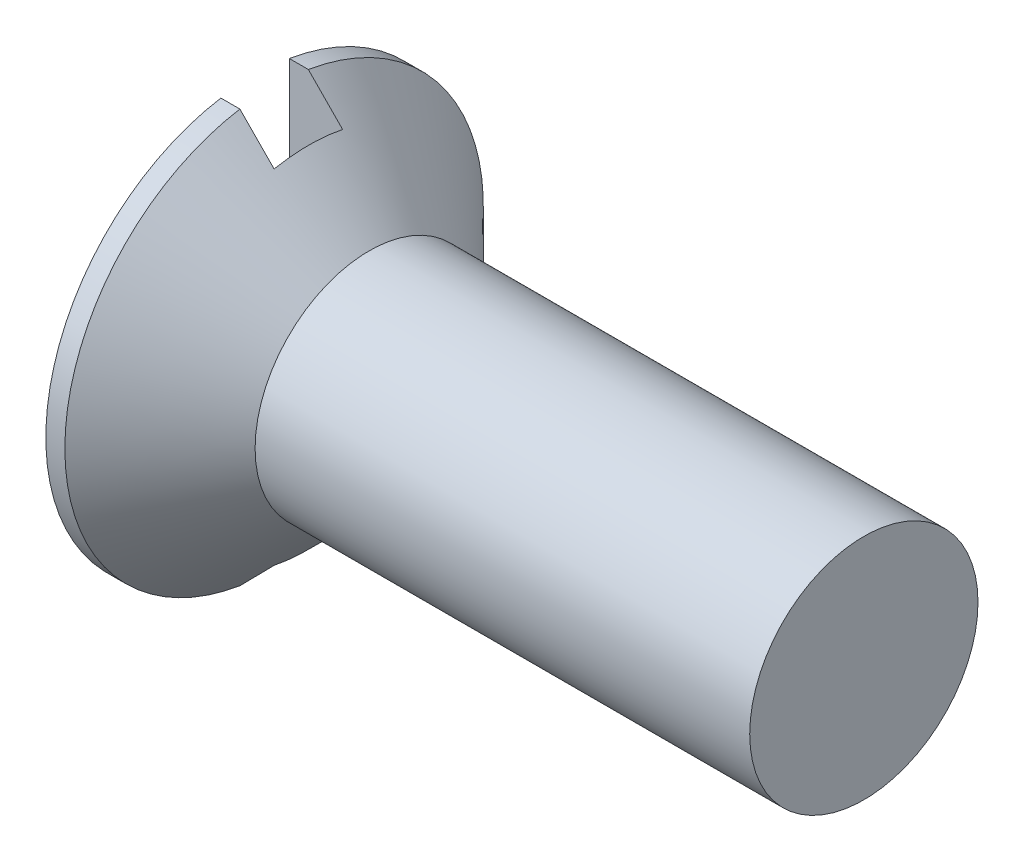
ISO-10303-21;
HEADER;
FILE_DESCRIPTION(('STEP AP214'),'2;1');
FILE_NAME('part.step','',(''),(''),'','','');
FILE_SCHEMA(('AUTOMOTIVE_DESIGN { 1 0 10303 214 1 1 1 1 }'));
ENDSEC;
DATA;
#1=APPLICATION_CONTEXT('core data for automotive mechanical design processes');
#2=APPLICATION_PROTOCOL_DEFINITION('international standard','automotive_design',2000,#1);
#3=PRODUCT_CONTEXT('',#1,'mechanical');
#4=PRODUCT('Part','Part','',(#3));
#5=PRODUCT_RELATED_PRODUCT_CATEGORY('part','',(#4));
#6=PRODUCT_DEFINITION_FORMATION('','',#4);
#7=PRODUCT_DEFINITION_CONTEXT('part definition',#1,'design');
#8=PRODUCT_DEFINITION('design','',#6,#7);
#9=PRODUCT_DEFINITION_SHAPE('','',#8);
#10=(LENGTH_UNIT() NAMED_UNIT(*) SI_UNIT(.MILLI.,.METRE.));
#11=(NAMED_UNIT(*) PLANE_ANGLE_UNIT() SI_UNIT($,.RADIAN.));
#12=(NAMED_UNIT(*) SI_UNIT($,.STERADIAN.) SOLID_ANGLE_UNIT());
#13=UNCERTAINTY_MEASURE_WITH_UNIT(LENGTH_MEASURE(1.E-05),#10,'distance_accuracy_value','');
#14=(GEOMETRIC_REPRESENTATION_CONTEXT(3) GLOBAL_UNCERTAINTY_ASSIGNED_CONTEXT((#13)) GLOBAL_UNIT_ASSIGNED_CONTEXT((#10,
#11,#12)) REPRESENTATION_CONTEXT('',''));
#15=CARTESIAN_POINT('',(0.,0.,0.));
#16=DIRECTION('',(0.,0.,1.));
#17=DIRECTION('',(1.,0.,0.));
#18=AXIS2_PLACEMENT_3D('',#15,#16,#17);
#19=CARTESIAN_POINT('',(0.,0.,0.));
#20=DIRECTION('',(-1.,0.,0.));
#21=DIRECTION('',(0.,0.,1.));
#22=AXIS2_PLACEMENT_3D('',#19,#20,#21);
#23=PLANE('',#22);
#24=CARTESIAN_POINT('',(0.,0.,0.));
#25=DIRECTION('',(-1.,0.,0.));
#26=DIRECTION('',(0.,0.,1.));
#27=AXIS2_PLACEMENT_3D('',#24,#25,#26);
#28=CIRCLE('',#27,5.5);
#29=CARTESIAN_POINT('',(0.,-5.42586398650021,0.9));
#30=VERTEX_POINT('',#29);
#31=CARTESIAN_POINT('',(0.,5.42586398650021,0.9));
#32=VERTEX_POINT('',#31);
#33=EDGE_CURVE('E116',#30,#32,#28,.T.);
#34=ORIENTED_EDGE('',*,*,#33,.T.);
#35=DIRECTION('',(0.,-1.,0.));
#36=VECTOR('',#35,1.);
#37=CARTESIAN_POINT('',(0.,5.42586398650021,0.9));
#38=LINE('',#37,#36);
#39=EDGE_CURVE('E112',#32,#30,#38,.T.);
#40=ORIENTED_EDGE('',*,*,#39,.T.);
#41=EDGE_LOOP('',(#34,#40));
#42=FACE_BOUND('',#41,.T.);
#43=ADVANCED_FACE('F37',(#42),#23,.T.);
#44=CARTESIAN_POINT('',(0.,5.42586398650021,-0.9));
#45=VERTEX_POINT('',#44);
#46=CARTESIAN_POINT('',(0.,-5.42586398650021,-0.900000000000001));
#47=VERTEX_POINT('',#46);
#48=EDGE_CURVE('E111',#45,#47,#28,.T.);
#49=ORIENTED_EDGE('',*,*,#48,.T.);
#50=DIRECTION('',(0.,1.,0.));
#51=VECTOR('',#50,1.);
#52=CARTESIAN_POINT('',(0.,-5.42586398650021,-0.900000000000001));
#53=LINE('',#52,#51);
#54=EDGE_CURVE('E97',#47,#45,#53,.T.);
#55=ORIENTED_EDGE('',*,*,#54,.T.);
#56=EDGE_LOOP('',(#49,#55));
#57=FACE_BOUND('',#56,.T.);
#58=ADVANCED_FACE('F110',(#57),#23,.T.);
#59=CARTESIAN_POINT('',(-6.34999999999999,0.,0.));
#60=DIRECTION('',(-1.,0.,0.));
#61=DIRECTION('',(0.,0.,1.));
#62=AXIS2_PLACEMENT_3D('',#59,#60,#61);
#63=CYLINDRICAL_SURFACE('',#62,5.5);
#64=ORIENTED_EDGE('',*,*,#33,.F.);
#65=DIRECTION('',(-1.,0.,0.));
#66=VECTOR('',#65,1.);
#67=CARTESIAN_POINT('',(1.4,-5.42586398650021,0.9));
#68=LINE('',#67,#66);
#69=CARTESIAN_POINT('',(0.500000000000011,-5.42586398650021,0.9));
#70=VERTEX_POINT('',#69);
#71=EDGE_CURVE('E163',#70,#30,#68,.T.);
#72=ORIENTED_EDGE('',*,*,#71,.F.);
#73=CARTESIAN_POINT('',(0.50000000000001,0.,0.));
#74=DIRECTION('',(-1.,0.,0.));
#75=DIRECTION('',(0.,0.,1.));
#76=AXIS2_PLACEMENT_3D('',#73,#74,#75);
#77=CIRCLE('',#76,5.5);
#78=CARTESIAN_POINT('',(0.50000000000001,5.42586398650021,0.9));
#79=VERTEX_POINT('',#78);
#80=EDGE_CURVE('E124',#70,#79,#77,.T.);
#81=ORIENTED_EDGE('',*,*,#80,.T.);
#82=DIRECTION('',(-1.,0.,0.));
#83=VECTOR('',#82,1.);
#84=CARTESIAN_POINT('',(1.4,5.42586398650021,0.9));
#85=LINE('',#84,#83);
#86=EDGE_CURVE('E64',#79,#32,#85,.T.);
#87=ORIENTED_EDGE('',*,*,#86,.T.);
#88=EDGE_LOOP('',(#64,#72,#81,#87));
#89=FACE_BOUND('',#88,.T.);
#90=ADVANCED_FACE('F157',(#89),#63,.T.);
#91=ORIENTED_EDGE('',*,*,#48,.F.);
#92=DIRECTION('',(-1.,0.,0.));
#93=VECTOR('',#92,1.);
#94=CARTESIAN_POINT('',(1.4,5.42586398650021,-0.9));
#95=LINE('',#94,#93);
#96=CARTESIAN_POINT('',(0.50000000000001,5.42586398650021,-0.9));
#97=VERTEX_POINT('',#96);
#98=EDGE_CURVE('E94',#97,#45,#95,.T.);
#99=ORIENTED_EDGE('',*,*,#98,.F.);
#100=CARTESIAN_POINT('',(0.500000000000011,-5.42586398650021,-0.900000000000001));
#101=VERTEX_POINT('',#100);
#102=EDGE_CURVE('E122',#97,#101,#77,.T.);
#103=ORIENTED_EDGE('',*,*,#102,.T.);
#104=DIRECTION('',(-1.,0.,0.));
#105=VECTOR('',#104,1.);
#106=CARTESIAN_POINT('',(1.4,-5.42586398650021,-0.900000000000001));
#107=LINE('',#106,#105);
#108=EDGE_CURVE('E106',#101,#47,#107,.T.);
#109=ORIENTED_EDGE('',*,*,#108,.T.);
#110=EDGE_LOOP('',(#91,#99,#103,#109));
#111=FACE_BOUND('',#110,.T.);
#112=ADVANCED_FACE('F114',(#111),#63,.T.);
#113=CARTESIAN_POINT('',(0.50000000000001,0.,0.));
#114=DIRECTION('',(-1.,0.,0.));
#115=DIRECTION('',(0.,0.,1.));
#116=AXIS2_PLACEMENT_3D('',#113,#114,#115);
#117=CONICAL_SURFACE('',#116,5.5,0.78539816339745);
#118=CARTESIAN_POINT('',(3.,0.,0.));
#119=DIRECTION('',(-1.,0.,0.));
#120=DIRECTION('',(0.,0.,1.));
#121=AXIS2_PLACEMENT_3D('',#118,#119,#120);
#122=CIRCLE('',#121,3.);
#123=CARTESIAN_POINT('',(3.,0.,3.));
#124=VERTEX_POINT('',#123);
#125=EDGE_CURVE('E167',#124,#124,#122,.T.);
#126=ORIENTED_EDGE('',*,*,#125,.T.);
#127=EDGE_LOOP('',(#126));
#128=FACE_BOUND('',#127,.T.);
#129=ORIENTED_EDGE('',*,*,#80,.F.);
#130=CARTESIAN_POINT('',(-5.99327175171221,-11.9594551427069,0.900000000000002));
#131=CARTESIAN_POINT('',(-5.57118728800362,-11.5361667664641,0.900000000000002));
#132=CARTESIAN_POINT('',(-5.14915624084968,-11.1128250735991,0.900000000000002));
#133=CARTESIAN_POINT('',(-4.30525902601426,-10.2659479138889,0.900000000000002));
#134=CARTESIAN_POINT('',(-3.88339286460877,-9.84241244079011,0.900000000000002));
#135=CARTESIAN_POINT('',(-3.03955445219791,-8.99472999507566,0.900000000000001));
#136=CARTESIAN_POINT('',(-2.61758241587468,-8.57058280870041,0.900000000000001));
#137=CARTESIAN_POINT('',(-1.77404447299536,-7.72191338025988,0.900000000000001));
#138=CARTESIAN_POINT('',(-1.35247855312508,-7.29739115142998,0.900000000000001));
#139=CARTESIAN_POINT('',(-0.527717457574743,-6.46559694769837,0.900000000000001));
#140=CARTESIAN_POINT('',(-0.124495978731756,-6.05835107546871,0.900000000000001));
#141=CARTESIAN_POINT('',(0.479560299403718,-5.44667415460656,0.900000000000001));
#142=CARTESIAN_POINT('',(0.680793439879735,-5.24263660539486,0.900000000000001));
#143=CARTESIAN_POINT('',(1.08287791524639,-4.83418948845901,0.900000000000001));
#144=CARTESIAN_POINT('',(1.28372925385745,-4.62977992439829,0.900000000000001));
#145=CARTESIAN_POINT('',(1.68477556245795,-4.2205254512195,0.900000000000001));
#146=CARTESIAN_POINT('',(1.88497081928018,-4.01568082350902,0.900000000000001));
#147=CARTESIAN_POINT('',(2.28451007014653,-3.60514784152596,0.900000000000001));
#148=CARTESIAN_POINT('',(2.4838540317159,-3.39945945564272,0.900000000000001));
#149=CARTESIAN_POINT('',(2.88110154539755,-2.98676121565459,0.900000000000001));
#150=CARTESIAN_POINT('',(3.07900534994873,-2.77975160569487,0.900000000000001));
#151=CARTESIAN_POINT('',(3.37385008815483,-2.46734931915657,0.900000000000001));
#152=CARTESIAN_POINT('',(3.47179358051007,-2.36290375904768,0.900000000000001));
#153=CARTESIAN_POINT('',(3.66669621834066,-2.15309905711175,0.900000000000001));
#154=CARTESIAN_POINT('',(3.76365538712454,-2.04773993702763,0.900000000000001));
#155=CARTESIAN_POINT('',(3.88656083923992,-1.91226955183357,0.900000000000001));
#156=CARTESIAN_POINT('',(3.91320187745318,-1.88278845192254,0.900000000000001));
#157=CARTESIAN_POINT('',(3.96634961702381,-1.82370529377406,0.900000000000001));
#158=CARTESIAN_POINT('',(3.9928563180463,-1.79410323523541,0.900000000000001));
#159=CARTESIAN_POINT('',(4.07215287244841,-1.70508762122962,0.900000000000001));
#160=CARTESIAN_POINT('',(4.1247142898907,-1.64547000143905,0.900000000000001));
#161=CARTESIAN_POINT('',(4.2293816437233,-1.52511614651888,0.900000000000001));
#162=CARTESIAN_POINT('',(4.281482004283,-1.46437504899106,0.900000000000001));
#163=CARTESIAN_POINT('',(4.38453321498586,-1.34194897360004,0.900000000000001));
#164=CARTESIAN_POINT('',(4.43548435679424,-1.28026424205,0.9));
#165=CARTESIAN_POINT('',(4.53615772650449,-1.15509031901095,0.9));
#166=CARTESIAN_POINT('',(4.58586718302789,-1.09159077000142,0.9));
#167=CARTESIAN_POINT('',(4.68278755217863,-0.962733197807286,0.9));
#168=CARTESIAN_POINT('',(4.72999923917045,-0.897375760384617,0.9));
#169=CARTESIAN_POINT('',(4.82027931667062,-0.764290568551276,0.9));
#170=CARTESIAN_POINT('',(4.86336857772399,-0.696577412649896,0.9));
#171=CARTESIAN_POINT('',(4.92300146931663,-0.592221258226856,0.9));
#172=CARTESIAN_POINT('',(4.94202984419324,-0.557006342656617,0.9));
#173=CARTESIAN_POINT('',(4.97788068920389,-0.485477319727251,0.9));
#174=CARTESIAN_POINT('',(4.99470439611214,-0.44916384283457,0.9));
#175=CARTESIAN_POINT('',(5.02159832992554,-0.384578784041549,0.9));
#176=CARTESIAN_POINT('',(5.03230428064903,-0.35657339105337,0.9));
#177=CARTESIAN_POINT('',(5.05173115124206,-0.29987175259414,0.9));
#178=CARTESIAN_POINT('',(5.06045198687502,-0.271175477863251,0.9));
#179=CARTESIAN_POINT('',(5.07549374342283,-0.213281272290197,0.9));
#180=CARTESIAN_POINT('',(5.08182467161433,-0.184085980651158,0.9));
#181=CARTESIAN_POINT('',(5.09179008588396,-0.125240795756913,0.9));
#182=CARTESIAN_POINT('',(5.09542545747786,-0.0955910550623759,0.9));
#183=CARTESIAN_POINT('',(5.09978847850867,-0.0357588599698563,0.9));
#184=CARTESIAN_POINT('',(5.10048514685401,-0.00557408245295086,0.9));
#185=CARTESIAN_POINT('',(5.09884445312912,0.0547054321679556,0.9));
#186=CARTESIAN_POINT('',(5.09650708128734,0.0848001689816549,0.9));
#187=CARTESIAN_POINT('',(5.0851242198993,0.174682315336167,0.9));
#188=CARTESIAN_POINT('',(5.07169957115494,0.233940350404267,0.9));
#189=CARTESIAN_POINT('',(5.04066079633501,0.334710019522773,0.9));
#190=CARTESIAN_POINT('',(5.02500223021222,0.376877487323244,0.9));
#191=CARTESIAN_POINT('',(4.99008133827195,0.459718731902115,0.9));
#192=CARTESIAN_POINT('',(4.97081631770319,0.500391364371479,0.9));
#193=CARTESIAN_POINT('',(4.9295604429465,0.580542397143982,0.9));
#194=CARTESIAN_POINT('',(4.90755733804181,0.620014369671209,0.9));
#195=CARTESIAN_POINT('',(4.8616157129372,0.697782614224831,0.9));
#196=CARTESIAN_POINT('',(4.8376779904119,0.736079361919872,0.9));
#197=CARTESIAN_POINT('',(4.78369155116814,0.818884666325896,0.9));
#198=CARTESIAN_POINT('',(4.75334375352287,0.86319695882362,0.9));
#199=CARTESIAN_POINT('',(4.69117135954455,0.950777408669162,0.9));
#200=CARTESIAN_POINT('',(4.65934647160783,0.994045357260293,0.9));
#201=CARTESIAN_POINT('',(4.56221305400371,1.12268659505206,0.9));
#202=CARTESIAN_POINT('',(4.49528797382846,1.20683512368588,0.9));
#203=CARTESIAN_POINT('',(4.35877688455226,1.37326327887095,0.9));
#204=CARTESIAN_POINT('',(4.28918466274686,1.45553772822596,0.9));
#205=CARTESIAN_POINT('',(4.14841726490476,1.61865810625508,0.9));
#206=CARTESIAN_POINT('',(4.07724275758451,1.69950461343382,0.9));
#207=CARTESIAN_POINT('',(3.93366181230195,1.86039458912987,0.9));
#208=CARTESIAN_POINT('',(3.86125311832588,1.94043603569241,0.9));
#209=CARTESIAN_POINT('',(3.71565970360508,2.09982387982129,0.9));
#210=CARTESIAN_POINT('',(3.6424749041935,2.17917020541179,0.9));
#211=CARTESIAN_POINT('',(3.49565889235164,2.33721584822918,0.9));
#212=CARTESIAN_POINT('',(3.42202856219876,2.41591598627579,0.9));
#213=CARTESIAN_POINT('',(3.27434700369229,2.57291475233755,0.9));
#214=CARTESIAN_POINT('',(3.20029579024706,2.65121339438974,0.9));
#215=CARTESIAN_POINT('',(2.97906622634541,2.88416585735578,0.9));
#216=CARTESIAN_POINT('',(2.83141561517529,3.03837098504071,0.9));
#217=CARTESIAN_POINT('',(2.5353115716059,3.34600903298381,0.9));
#218=CARTESIAN_POINT('',(2.38685813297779,3.49944194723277,0.9));
#219=CARTESIAN_POINT('',(1.94068895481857,3.95897399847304,0.9));
#220=CARTESIAN_POINT('',(1.64217383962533,4.264296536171,0.9));
#221=CARTESIAN_POINT('',(1.04387274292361,4.87406918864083,0.9));
#222=CARTESIAN_POINT('',(0.744086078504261,5.17851863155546,0.9));
#223=CARTESIAN_POINT('',(0.143867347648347,5.78677110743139,0.9));
#224=CARTESIAN_POINT('',(-0.156564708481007,6.090574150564,0.9));
#225=CARTESIAN_POINT('',(-0.757083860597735,6.69701043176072,0.9));
#226=CARTESIAN_POINT('',(-1.05716992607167,6.9996446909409,0.9));
#227=CARTESIAN_POINT('',(-1.65762142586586,7.60463839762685,0.9));
#228=CARTESIAN_POINT('',(-1.95798686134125,7.90699784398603,0.899999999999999));
#229=CARTESIAN_POINT('',(-2.85927340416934,8.81368934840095,0.899999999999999));
#230=CARTESIAN_POINT('',(-3.46048346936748,9.41773413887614,0.899999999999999));
#231=CARTESIAN_POINT('',(-4.22272340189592,10.183038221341,0.899999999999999));
#232=CARTESIAN_POINT('',(-4.38355932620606,10.3444908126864,0.899999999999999));
#233=CARTESIAN_POINT('',(-4.70526313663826,10.667373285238,0.899999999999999));
#234=CARTESIAN_POINT('',(-4.86613102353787,10.8288031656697,0.899999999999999));
#235=CARTESIAN_POINT('',(-5.18803469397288,11.1517843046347,0.899999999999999));
#236=CARTESIAN_POINT('',(-5.34907049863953,11.3133355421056,0.899999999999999));
#237=CARTESIAN_POINT('',(-5.6711584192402,11.6364125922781,0.899999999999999));
#238=CARTESIAN_POINT('',(-5.83221053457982,11.7979384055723,0.899999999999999));
#239=CARTESIAN_POINT('',(-5.99327175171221,11.9594551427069,0.899999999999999));
#240=B_SPLINE_CURVE_WITH_KNOTS('',3,(#130,#131,#132,#133,#134,#135,#136,#137,#138,#139,#140,
#141,#142,#143,#144,#145,#146,#147,#148,#149,#150,#151,#152,#153,#154,#155,#156,#157,#158,#159,
#160,#161,#162,#163,#164,#165,#166,#167,#168,#169,#170,#171,#172,#173,#174,#175,#176,#177,#178,
#179,#180,#181,#182,#183,#184,#185,#186,#187,#188,#189,#190,#191,#192,#193,#194,#195,#196,#197,
#198,#199,#200,#201,#202,#203,#204,#205,#206,#207,#208,#209,#210,#211,#212,#213,#214,#215,#216,
#217,#218,#219,#220,#221,#222,#223,#224,#225,#226,#227,#228,#229,#230,#231,#232,#233,#234,#235,
#236,#237,#238,#239),.UNSPECIFIED.,.F.,.F.,(4,2,2,2,2,2,2,2,2,2,2,2,2,2,2,2,2,2,2,2,2,2,2,2,2,2,
2,2,2,2,2,2,2,2,2,2,2,2,2,2,2,2,2,2,2,2,2,2,2,2,2,2,2,2,4),(0.,1.79330847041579,
3.58667959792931,5.38157526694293,7.1764099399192,8.89569071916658,9.75541990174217,
10.6151406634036,11.474414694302,12.333721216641,13.1928732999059,13.6224234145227,
14.0519633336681,14.1711683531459,14.2903736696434,14.5288060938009,14.7688696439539,
15.0088715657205,15.250755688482,15.492564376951,15.7330757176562,15.853102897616,
15.9730624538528,16.0629484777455,16.1528383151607,16.2423474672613,16.3318272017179,
16.4222479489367,16.5126689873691,16.6938869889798,16.8286598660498,16.9635338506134,
17.0990345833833,17.2344797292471,17.395561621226,17.5566754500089,17.8791281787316,
18.2023840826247,18.5255058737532,18.8493002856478,19.1731278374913,19.4964464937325,
19.8197537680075,20.4602320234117,21.1007152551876,22.3817228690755,23.6635385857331,
24.9453339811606,26.223908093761,27.5024875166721,30.0592257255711,30.7429041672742,
31.426602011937,32.1109133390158,32.7952051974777),.UNSPECIFIED.);
#241=CARTESIAN_POINT('',(1.4,-4.51109742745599,0.900000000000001));
#242=VERTEX_POINT('',#241);
#243=EDGE_CURVE('E11',#70,#242,#240,.T.);
#244=ORIENTED_EDGE('',*,*,#243,.T.);
#245=CARTESIAN_POINT('',(1.4,0.,0.));
#246=DIRECTION('',(-1.,0.,0.));
#247=DIRECTION('',(0.,0.,1.));
#248=AXIS2_PLACEMENT_3D('',#245,#246,#247);
#249=CIRCLE('',#248,4.6);
#250=CARTESIAN_POINT('',(1.4,-4.51109742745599,-0.900000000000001));
#251=VERTEX_POINT('',#250);
#252=EDGE_CURVE('E120',#242,#251,#249,.F.);
#253=ORIENTED_EDGE('',*,*,#252,.T.);
#254=CARTESIAN_POINT('',(-5.99327175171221,11.9594551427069,-0.899999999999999));
#255=CARTESIAN_POINT('',(-5.57118728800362,11.5361667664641,-0.899999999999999));
#256=CARTESIAN_POINT('',(-5.14915624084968,11.1128250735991,-0.899999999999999));
#257=CARTESIAN_POINT('',(-4.30525902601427,10.2659479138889,-0.899999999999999));
#258=CARTESIAN_POINT('',(-3.88339286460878,9.84241244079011,-0.899999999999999));
#259=CARTESIAN_POINT('',(-3.03955445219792,8.99472999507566,-0.899999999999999));
#260=CARTESIAN_POINT('',(-2.61758241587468,8.57058280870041,-0.899999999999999));
#261=CARTESIAN_POINT('',(-1.77404447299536,7.72191338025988,-0.899999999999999));
#262=CARTESIAN_POINT('',(-1.35247855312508,7.29739115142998,-0.899999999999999));
#263=CARTESIAN_POINT('',(-0.527717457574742,6.46559694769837,-0.9));
#264=CARTESIAN_POINT('',(-0.124495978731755,6.05835107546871,-0.9));
#265=CARTESIAN_POINT('',(0.479560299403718,5.44667415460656,-0.9));
#266=CARTESIAN_POINT('',(0.680793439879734,5.24263660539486,-0.9));
#267=CARTESIAN_POINT('',(1.08287791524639,4.83418948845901,-0.9));
#268=CARTESIAN_POINT('',(1.28372925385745,4.62977992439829,-0.9));
#269=CARTESIAN_POINT('',(1.68477556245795,4.2205254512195,-0.9));
#270=CARTESIAN_POINT('',(1.88497081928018,4.01568082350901,-0.9));
#271=CARTESIAN_POINT('',(2.28451007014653,3.60514784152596,-0.9));
#272=CARTESIAN_POINT('',(2.4838540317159,3.39945945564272,-0.9));
#273=CARTESIAN_POINT('',(2.88110154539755,2.98676121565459,-0.9));
#274=CARTESIAN_POINT('',(3.07900534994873,2.77975160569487,-0.9));
#275=CARTESIAN_POINT('',(3.37385008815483,2.46734931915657,-0.9));
#276=CARTESIAN_POINT('',(3.47179358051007,2.36290375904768,-0.9));
#277=CARTESIAN_POINT('',(3.66669621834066,2.15309905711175,-0.9));
#278=CARTESIAN_POINT('',(3.76365538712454,2.04773993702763,-0.9));
#279=CARTESIAN_POINT('',(3.88656083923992,1.91226955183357,-0.9));
#280=CARTESIAN_POINT('',(3.91320187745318,1.88278845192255,-0.9));
#281=CARTESIAN_POINT('',(3.96634961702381,1.82370529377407,-0.9));
#282=CARTESIAN_POINT('',(3.9928563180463,1.79410323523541,-0.9));
#283=CARTESIAN_POINT('',(4.07215287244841,1.70508762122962,-0.9));
#284=CARTESIAN_POINT('',(4.1247142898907,1.64547000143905,-0.9));
#285=CARTESIAN_POINT('',(4.2293816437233,1.52511614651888,-0.9));
#286=CARTESIAN_POINT('',(4.281482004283,1.46437504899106,-0.9));
#287=CARTESIAN_POINT('',(4.38453321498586,1.34194897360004,-0.9));
#288=CARTESIAN_POINT('',(4.43548435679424,1.28026424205,-0.9));
#289=CARTESIAN_POINT('',(4.53615772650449,1.15509031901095,-0.9));
#290=CARTESIAN_POINT('',(4.58586718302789,1.09159077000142,-0.9));
#291=CARTESIAN_POINT('',(4.68278755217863,0.962733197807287,-0.9));
#292=CARTESIAN_POINT('',(4.72999923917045,0.897375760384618,-0.9));
#293=CARTESIAN_POINT('',(4.82027931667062,0.764290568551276,-0.9));
#294=CARTESIAN_POINT('',(4.86336857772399,0.696577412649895,-0.9));
#295=CARTESIAN_POINT('',(4.92300146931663,0.592221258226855,-0.9));
#296=CARTESIAN_POINT('',(4.94202984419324,0.557006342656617,-0.9));
#297=CARTESIAN_POINT('',(4.97788068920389,0.485477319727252,-0.9));
#298=CARTESIAN_POINT('',(4.99470439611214,0.44916384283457,-0.9));
#299=CARTESIAN_POINT('',(5.02159832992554,0.384578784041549,-0.9));
#300=CARTESIAN_POINT('',(5.03230428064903,0.35657339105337,-0.9));
#301=CARTESIAN_POINT('',(5.05173115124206,0.29987175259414,-0.9));
#302=CARTESIAN_POINT('',(5.06045198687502,0.271175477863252,-0.9));
#303=CARTESIAN_POINT('',(5.07549374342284,0.213281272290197,-0.9));
#304=CARTESIAN_POINT('',(5.08182467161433,0.184085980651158,-0.9));
#305=CARTESIAN_POINT('',(5.09179008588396,0.125240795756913,-0.9));
#306=CARTESIAN_POINT('',(5.09542545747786,0.0955910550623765,-0.9));
#307=CARTESIAN_POINT('',(5.09978847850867,0.0357588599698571,-0.9));
#308=CARTESIAN_POINT('',(5.10048514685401,0.00557408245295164,-0.9));
#309=CARTESIAN_POINT('',(5.09884445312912,-0.0547054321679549,-0.9));
#310=CARTESIAN_POINT('',(5.09650708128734,-0.0848001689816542,-0.9));
#311=CARTESIAN_POINT('',(5.08512421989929,-0.174682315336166,-0.9));
#312=CARTESIAN_POINT('',(5.07169957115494,-0.233940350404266,-0.9));
#313=CARTESIAN_POINT('',(5.04066079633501,-0.334710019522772,-0.9));
#314=CARTESIAN_POINT('',(5.02500223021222,-0.376877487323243,-0.9));
#315=CARTESIAN_POINT('',(4.99008133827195,-0.459718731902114,-0.9));
#316=CARTESIAN_POINT('',(4.97081631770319,-0.500391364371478,-0.9));
#317=CARTESIAN_POINT('',(4.9295604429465,-0.58054239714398,-0.9));
#318=CARTESIAN_POINT('',(4.90755733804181,-0.620014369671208,-0.9));
#319=CARTESIAN_POINT('',(4.8616157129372,-0.697782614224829,-0.9));
#320=CARTESIAN_POINT('',(4.8376779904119,-0.73607936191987,-0.9));
#321=CARTESIAN_POINT('',(4.78369155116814,-0.818884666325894,-0.9));
#322=CARTESIAN_POINT('',(4.75334375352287,-0.863196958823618,-0.9));
#323=CARTESIAN_POINT('',(4.69117135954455,-0.950777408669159,-0.9));
#324=CARTESIAN_POINT('',(4.65934647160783,-0.99404535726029,-0.9));
#325=CARTESIAN_POINT('',(4.56221305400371,-1.12268659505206,-0.9));
#326=CARTESIAN_POINT('',(4.49528797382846,-1.20683512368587,-0.9));
#327=CARTESIAN_POINT('',(4.35877688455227,-1.37326327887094,-0.9));
#328=CARTESIAN_POINT('',(4.28918466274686,-1.45553772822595,-0.900000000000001));
#329=CARTESIAN_POINT('',(4.14841726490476,-1.61865810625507,-0.900000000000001));
#330=CARTESIAN_POINT('',(4.07724275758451,-1.69950461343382,-0.900000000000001));
#331=CARTESIAN_POINT('',(3.93366181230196,-1.86039458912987,-0.900000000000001));
#332=CARTESIAN_POINT('',(3.86125311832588,-1.9404360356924,-0.900000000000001));
#333=CARTESIAN_POINT('',(3.71565970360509,-2.09982387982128,-0.900000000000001));
#334=CARTESIAN_POINT('',(3.6424749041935,-2.17917020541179,-0.900000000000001));
#335=CARTESIAN_POINT('',(3.49565889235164,-2.33721584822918,-0.900000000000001));
#336=CARTESIAN_POINT('',(3.42202856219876,-2.41591598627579,-0.900000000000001));
#337=CARTESIAN_POINT('',(3.27434700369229,-2.57291475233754,-0.900000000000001));
#338=CARTESIAN_POINT('',(3.20029579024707,-2.65121339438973,-0.900000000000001));
#339=CARTESIAN_POINT('',(2.97906622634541,-2.88416585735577,-0.900000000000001));
#340=CARTESIAN_POINT('',(2.8314156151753,-3.03837098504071,-0.900000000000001));
#341=CARTESIAN_POINT('',(2.5353115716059,-3.3460090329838,-0.900000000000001));
#342=CARTESIAN_POINT('',(2.3868581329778,-3.49944194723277,-0.900000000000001));
#343=CARTESIAN_POINT('',(1.94068895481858,-3.95897399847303,-0.900000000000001));
#344=CARTESIAN_POINT('',(1.64217383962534,-4.26429653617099,-0.900000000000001));
#345=CARTESIAN_POINT('',(1.04387274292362,-4.87406918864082,-0.900000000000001));
#346=CARTESIAN_POINT('',(0.744086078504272,-5.17851863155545,-0.900000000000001));
#347=CARTESIAN_POINT('',(0.143867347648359,-5.78677110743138,-0.900000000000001));
#348=CARTESIAN_POINT('',(-0.156564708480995,-6.09057415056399,-0.900000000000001));
#349=CARTESIAN_POINT('',(-0.757083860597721,-6.69701043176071,-0.900000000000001));
#350=CARTESIAN_POINT('',(-1.05716992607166,-6.99964469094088,-0.900000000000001));
#351=CARTESIAN_POINT('',(-1.65762142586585,-7.60463839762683,-0.900000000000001));
#352=CARTESIAN_POINT('',(-1.95798686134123,-7.90699784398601,-0.900000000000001));
#353=CARTESIAN_POINT('',(-2.85927340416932,-8.81368934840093,-0.900000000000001));
#354=CARTESIAN_POINT('',(-3.46048346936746,-9.41773413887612,-0.900000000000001));
#355=CARTESIAN_POINT('',(-4.22272340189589,-10.1830382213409,-0.900000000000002));
#356=CARTESIAN_POINT('',(-4.38355932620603,-10.3444908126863,-0.900000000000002));
#357=CARTESIAN_POINT('',(-4.70526313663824,-10.667373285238,-0.900000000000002));
#358=CARTESIAN_POINT('',(-4.86613102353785,-10.8288031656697,-0.900000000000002));
#359=CARTESIAN_POINT('',(-5.18803469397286,-11.1517843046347,-0.900000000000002));
#360=CARTESIAN_POINT('',(-5.34907049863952,-11.3133355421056,-0.900000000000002));
#361=CARTESIAN_POINT('',(-5.6711584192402,-11.6364125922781,-0.900000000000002));
#362=CARTESIAN_POINT('',(-5.83221053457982,-11.7979384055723,-0.900000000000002));
#363=CARTESIAN_POINT('',(-5.99327175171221,-11.9594551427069,-0.900000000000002));
#364=B_SPLINE_CURVE_WITH_KNOTS('',3,(#254,#255,#256,#257,#258,#259,#260,#261,#262,#263,#264,
#265,#266,#267,#268,#269,#270,#271,#272,#273,#274,#275,#276,#277,#278,#279,#280,#281,#282,#283,
#284,#285,#286,#287,#288,#289,#290,#291,#292,#293,#294,#295,#296,#297,#298,#299,#300,#301,#302,
#303,#304,#305,#306,#307,#308,#309,#310,#311,#312,#313,#314,#315,#316,#317,#318,#319,#320,#321,
#322,#323,#324,#325,#326,#327,#328,#329,#330,#331,#332,#333,#334,#335,#336,#337,#338,#339,#340,
#341,#342,#343,#344,#345,#346,#347,#348,#349,#350,#351,#352,#353,#354,#355,#356,#357,#358,#359,
#360,#361,#362,#363),.UNSPECIFIED.,.F.,.F.,(4,2,2,2,2,2,2,2,2,2,2,2,2,2,2,2,2,2,2,2,2,2,2,2,2,2,
2,2,2,2,2,2,2,2,2,2,2,2,2,2,2,2,2,2,2,2,2,2,2,2,2,2,2,2,4),(0.,1.79330847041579,
3.58667959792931,5.38157526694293,7.1764099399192,8.89569071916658,9.75541990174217,
10.6151406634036,11.474414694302,12.333721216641,13.1928732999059,13.6224234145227,
14.0519633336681,14.1711683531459,14.2903736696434,14.5288060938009,14.7688696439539,
15.0088715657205,15.250755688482,15.492564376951,15.7330757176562,15.853102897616,
15.9730624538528,16.0629484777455,16.1528383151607,16.2423474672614,16.3318272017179,
16.4222479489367,16.5126689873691,16.6938869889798,16.8286598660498,16.9635338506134,
17.0990345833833,17.2344797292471,17.395561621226,17.5566754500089,17.8791281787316,
18.2023840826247,18.5255058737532,18.8493002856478,19.1731278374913,19.4964464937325,
19.8197537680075,20.4602320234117,21.1007152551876,22.3817228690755,23.6635385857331,
24.9453339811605,26.223908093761,27.502487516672,30.0592257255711,30.7429041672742,
31.426602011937,32.1109133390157,32.7952051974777),.UNSPECIFIED.);
#365=EDGE_CURVE('E50',#251,#101,#364,.T.);
#366=ORIENTED_EDGE('',*,*,#365,.T.);
#367=ORIENTED_EDGE('',*,*,#102,.F.);
#368=CARTESIAN_POINT('',(1.4,4.51109742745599,-0.9));
#369=VERTEX_POINT('',#368);
#370=EDGE_CURVE('E101',#97,#369,#364,.T.);
#371=ORIENTED_EDGE('',*,*,#370,.T.);
#372=CARTESIAN_POINT('',(1.4,4.51109742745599,0.9));
#373=VERTEX_POINT('',#372);
#374=EDGE_CURVE('E115',#369,#373,#249,.F.);
#375=ORIENTED_EDGE('',*,*,#374,.T.);
#376=EDGE_CURVE('E40',#373,#79,#240,.T.);
#377=ORIENTED_EDGE('',*,*,#376,.T.);
#378=EDGE_LOOP('',(#129,#244,#253,#366,#367,#371,#375,#377));
#379=FACE_BOUND('',#378,.T.);
#380=ADVANCED_FACE('F130',(#128,#379),#117,.T.);
#381=CARTESIAN_POINT('',(-6.34999999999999,0.,0.));
#382=DIRECTION('',(-1.,0.,0.));
#383=DIRECTION('',(0.,0.,1.));
#384=AXIS2_PLACEMENT_3D('',#381,#382,#383);
#385=CYLINDRICAL_SURFACE('',#384,3.);
#386=CARTESIAN_POINT('',(16.,0.,0.));
#387=DIRECTION('',(-1.,0.,0.));
#388=DIRECTION('',(0.,0.,1.));
#389=AXIS2_PLACEMENT_3D('',#386,#387,#388);
#390=CIRCLE('',#389,3.);
#391=CARTESIAN_POINT('',(16.,0.,3.));
#392=VERTEX_POINT('',#391);
#393=EDGE_CURVE('E165',#392,#392,#390,.T.);
#394=ORIENTED_EDGE('',*,*,#393,.T.);
#395=EDGE_LOOP('',(#394));
#396=FACE_BOUND('',#395,.T.);
#397=ORIENTED_EDGE('',*,*,#125,.F.);
#398=EDGE_LOOP('',(#397));
#399=FACE_BOUND('',#398,.T.);
#400=ADVANCED_FACE('F142',(#396,#399),#385,.T.);
#401=CARTESIAN_POINT('',(16.,3.,0.));
#402=DIRECTION('',(1.,0.,0.));
#403=DIRECTION('',(0.,0.,-1.));
#404=AXIS2_PLACEMENT_3D('',#401,#402,#403);
#405=PLANE('',#404);
#406=ORIENTED_EDGE('',*,*,#393,.F.);
#407=EDGE_LOOP('',(#406));
#408=FACE_BOUND('',#407,.T.);
#409=ADVANCED_FACE('F140',(#408),#405,.T.);
#410=CARTESIAN_POINT('',(1.4,5.42586398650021,0.9));
#411=DIRECTION('',(0.,0.,-1.));
#412=DIRECTION('',(0.,1.,0.));
#413=AXIS2_PLACEMENT_3D('',#410,#411,#412);
#414=PLANE('',#413);
#415=ORIENTED_EDGE('',*,*,#71,.T.);
#416=ORIENTED_EDGE('',*,*,#39,.F.);
#417=ORIENTED_EDGE('',*,*,#86,.F.);
#418=ORIENTED_EDGE('',*,*,#376,.F.);
#419=DIRECTION('',(0.,-1.,0.));
#420=VECTOR('',#419,1.);
#421=CARTESIAN_POINT('',(1.4,5.42586398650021,0.9));
#422=LINE('',#421,#420);
#423=EDGE_CURVE('E57',#373,#242,#422,.T.);
#424=ORIENTED_EDGE('',*,*,#423,.T.);
#425=ORIENTED_EDGE('',*,*,#243,.F.);
#426=EDGE_LOOP('',(#415,#416,#417,#418,#424,#425));
#427=FACE_BOUND('',#426,.T.);
#428=ADVANCED_FACE('F137',(#427),#414,.T.);
#429=CARTESIAN_POINT('',(1.4,-5.42586398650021,-0.900000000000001));
#430=DIRECTION('',(0.,0.,1.));
#431=DIRECTION('',(0.,-1.,0.));
#432=AXIS2_PLACEMENT_3D('',#429,#430,#431);
#433=PLANE('',#432);
#434=ORIENTED_EDGE('',*,*,#98,.T.);
#435=ORIENTED_EDGE('',*,*,#54,.F.);
#436=ORIENTED_EDGE('',*,*,#108,.F.);
#437=ORIENTED_EDGE('',*,*,#365,.F.);
#438=DIRECTION('',(0.,1.,0.));
#439=VECTOR('',#438,1.);
#440=CARTESIAN_POINT('',(1.4,-5.42586398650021,-0.900000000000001));
#441=LINE('',#440,#439);
#442=EDGE_CURVE('E178',#251,#369,#441,.T.);
#443=ORIENTED_EDGE('',*,*,#442,.T.);
#444=ORIENTED_EDGE('',*,*,#370,.F.);
#445=EDGE_LOOP('',(#434,#435,#436,#437,#443,#444));
#446=FACE_BOUND('',#445,.T.);
#447=ADVANCED_FACE('F96',(#446),#433,.T.);
#448=CARTESIAN_POINT('',(1.4,0.,0.));
#449=DIRECTION('',(-1.,0.,0.));
#450=DIRECTION('',(0.,0.,1.));
#451=AXIS2_PLACEMENT_3D('',#448,#449,#450);
#452=PLANE('',#451);
#453=ORIENTED_EDGE('',*,*,#423,.F.);
#454=ORIENTED_EDGE('',*,*,#374,.F.);
#455=ORIENTED_EDGE('',*,*,#442,.F.);
#456=ORIENTED_EDGE('',*,*,#252,.F.);
#457=EDGE_LOOP('',(#453,#454,#455,#456));
#458=FACE_BOUND('',#457,.T.);
#459=ADVANCED_FACE('F136',(#458),#452,.T.);
#460=CLOSED_SHELL('',(#43,#58,#90,#112,#380,#400,#409,#428,#447,#459));
#461=MANIFOLD_SOLID_BREP('B2',#460);
#462=ADVANCED_BREP_SHAPE_REPRESENTATION('',(#18,#461),#14);
#463=SHAPE_DEFINITION_REPRESENTATION(#9,#462);
ENDSEC;
END-ISO-10303-21;
